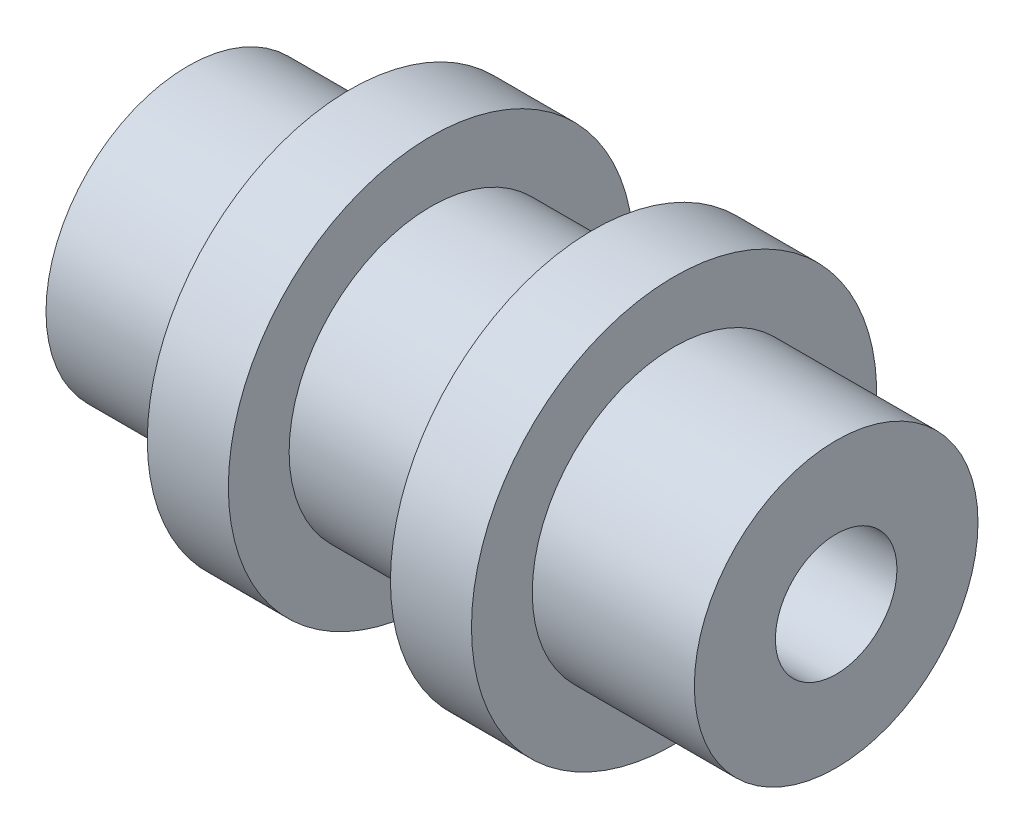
from build123d import *

# Parameters (mm, degrees)
SKETCH2_R          = 3
CUT_EXTRUDE1_DEPTH = 35.985711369


with BuildPart() as part:
    # Sketch1 → Revolve1 (revolve)
    with BuildSketch(Plane(origin=(0, 0, 0), x_dir=(1, 0, 0), z_dir=(0, 1, 0)), mode=Mode.PRIVATE) as revolve1_sk:
        Polygon((-16, 0), (16, 0), (16, 7), (8, 7), (8, 10), (4, 10), (4, 7), (-4, 7), (-4, 10), (-8, 10), (-8, 7), (-16, 7), align=None)
    revolve(revolve1_sk.sketch.rotate(Axis((-16, 0, 0), (1, 0, 0)), 180), axis=Axis((-16, 0, 0), (1, 0, 0)))

    # Sketch2 → Cut-Extrude1 (cut, through all)
    with BuildSketch(Plane(origin=(16, 0, 0), x_dir=(0, 0, -1), z_dir=(1, 0, 0))):
        Circle(SKETCH2_R)
    extrude(amount=-CUT_EXTRUDE1_DEPTH, mode=Mode.SUBTRACT)


solid = part.part
